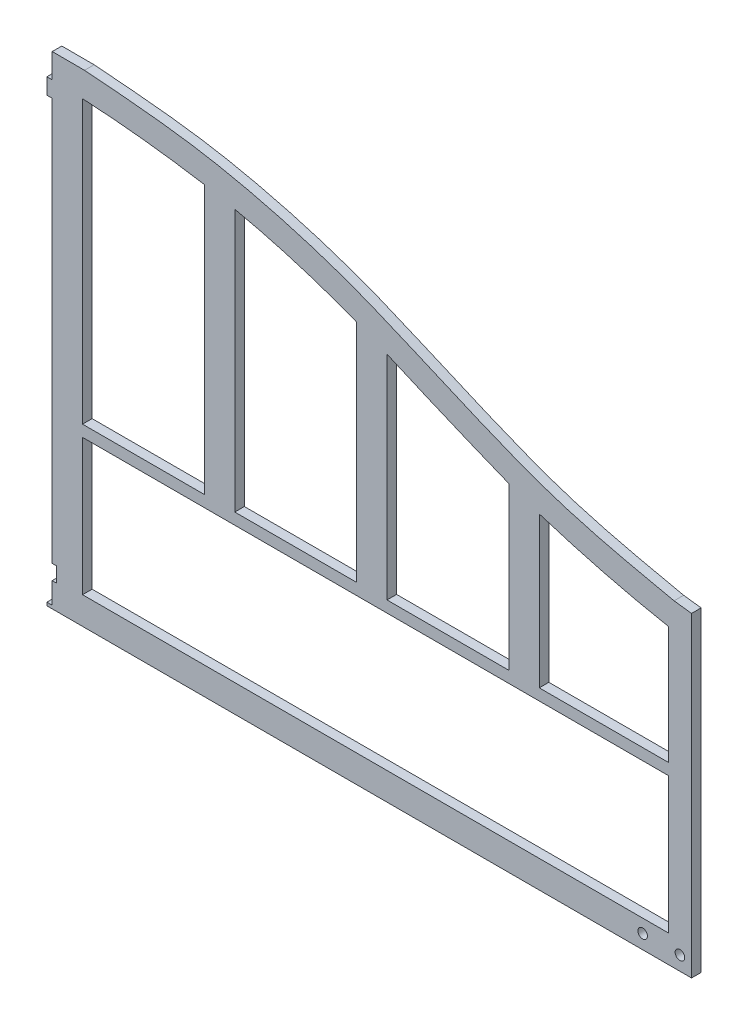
ISO-10303-21;
HEADER;
FILE_DESCRIPTION(('STEP AP214'),'2;1');
FILE_NAME('part.step','',(''),(''),'','','');
FILE_SCHEMA(('AUTOMOTIVE_DESIGN { 1 0 10303 214 1 1 1 1 }'));
ENDSEC;
DATA;
#1=APPLICATION_CONTEXT('core data for automotive mechanical design processes');
#2=APPLICATION_PROTOCOL_DEFINITION('international standard','automotive_design',2000,#1);
#3=PRODUCT_CONTEXT('',#1,'mechanical');
#4=PRODUCT('Part','Part','',(#3));
#5=PRODUCT_RELATED_PRODUCT_CATEGORY('part','',(#4));
#6=PRODUCT_DEFINITION_FORMATION('','',#4);
#7=PRODUCT_DEFINITION_CONTEXT('part definition',#1,'design');
#8=PRODUCT_DEFINITION('design','',#6,#7);
#9=PRODUCT_DEFINITION_SHAPE('','',#8);
#10=(LENGTH_UNIT() NAMED_UNIT(*) SI_UNIT(.MILLI.,.METRE.));
#11=(NAMED_UNIT(*) PLANE_ANGLE_UNIT() SI_UNIT($,.RADIAN.));
#12=(NAMED_UNIT(*) SI_UNIT($,.STERADIAN.) SOLID_ANGLE_UNIT());
#13=UNCERTAINTY_MEASURE_WITH_UNIT(LENGTH_MEASURE(1.E-05),#10,'distance_accuracy_value','');
#14=(GEOMETRIC_REPRESENTATION_CONTEXT(3) GLOBAL_UNCERTAINTY_ASSIGNED_CONTEXT((#13)) GLOBAL_UNIT_ASSIGNED_CONTEXT((#10,
#11,#12)) REPRESENTATION_CONTEXT('',''));
#15=CARTESIAN_POINT('',(0.,0.,0.));
#16=DIRECTION('',(0.,0.,1.));
#17=DIRECTION('',(1.,0.,0.));
#18=AXIS2_PLACEMENT_3D('',#15,#16,#17);
#19=CARTESIAN_POINT('',(321.765130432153,389.200273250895,9.));
#20=DIRECTION('',(0.,0.,-1.));
#21=DIRECTION('',(-1.,0.,0.));
#22=AXIS2_PLACEMENT_3D('',#19,#20,#21);
#23=PLANE('',#22);
#24=CARTESIAN_POINT('',(594.14,13.26,9.));
#25=DIRECTION('',(0.,0.,1.));
#26=DIRECTION('',(1.,0.,0.));
#27=AXIS2_PLACEMENT_3D('',#24,#25,#26);
#28=CIRCLE('',#27,4.49999999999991);
#29=CARTESIAN_POINT('',(598.64,13.26,9.));
#30=VERTEX_POINT('',#29);
#31=EDGE_CURVE('E296',#30,#30,#28,.T.);
#32=ORIENTED_EDGE('',*,*,#31,.F.);
#33=EDGE_LOOP('',(#32));
#34=FACE_BOUND('',#33,.T.);
#35=DIRECTION('',(0.,-1.,0.));
#36=VECTOR('',#35,1.);
#37=CARTESIAN_POINT('',(319.22,164.37,9.));
#38=LINE('',#37,#36);
#39=CARTESIAN_POINT('',(319.219999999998,364.150000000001,9.));
#40=VERTEX_POINT('',#39);
#41=CARTESIAN_POINT('',(319.22,164.37,9.));
#42=VERTEX_POINT('',#41);
#43=EDGE_CURVE('E306',#40,#42,#38,.T.);
#44=ORIENTED_EDGE('',*,*,#43,.F.);
#45=CARTESIAN_POINT('',(1744.55075063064,3598.67238732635,9.));
#46=DIRECTION('',(0.,0.,-1.));
#47=DIRECTION('',(1.,0.,0.));
#48=AXIS2_PLACEMENT_3D('',#45,#46,#47);
#49=CIRCLE('',#48,3534.64323840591);
#50=CARTESIAN_POINT('',(433.64,316.11,9.));
#51=VERTEX_POINT('',#50);
#52=EDGE_CURVE('E314',#51,#40,#49,.T.);
#53=ORIENTED_EDGE('',*,*,#52,.F.);
#54=DIRECTION('',(0.,1.,0.));
#55=VECTOR('',#54,1.);
#56=CARTESIAN_POINT('',(433.64,164.37,9.));
#57=LINE('',#56,#55);
#58=CARTESIAN_POINT('',(433.64,164.37,9.));
#59=VERTEX_POINT('',#58);
#60=EDGE_CURVE('E311',#59,#51,#57,.T.);
#61=ORIENTED_EDGE('',*,*,#60,.F.);
#62=DIRECTION('',(1.,0.,0.));
#63=VECTOR('',#62,1.);
#64=CARTESIAN_POINT('',(319.22,164.37,9.));
#65=LINE('',#64,#63);
#66=EDGE_CURVE('E308',#42,#59,#65,.T.);
#67=ORIENTED_EDGE('',*,*,#66,.F.);
#68=EDGE_LOOP('',(#44,#53,#61,#67));
#69=FACE_BOUND('',#68,.T.);
#70=DIRECTION('',(0.,-1.,0.));
#71=VECTOR('',#70,1.);
#72=CARTESIAN_POINT('',(33.46,164.37,9.));
#73=LINE('',#72,#71);
#74=CARTESIAN_POINT('',(33.4600000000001,428.94,9.));
#75=VERTEX_POINT('',#74);
#76=CARTESIAN_POINT('',(33.46,164.37,9.));
#77=VERTEX_POINT('',#76);
#78=EDGE_CURVE('E368',#75,#77,#73,.T.);
#79=ORIENTED_EDGE('',*,*,#78,.F.);
#80=CARTESIAN_POINT('',(-23.1208114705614,-603.405366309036,9.));
#81=DIRECTION('',(0.,0.,1.));
#82=DIRECTION('',(-1.,0.,0.));
#83=AXIS2_PLACEMENT_3D('',#80,#81,#82);
#84=CIRCLE('',#83,1033.89474491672);
#85=CARTESIAN_POINT('',(147.88,416.25,9.));
#86=VERTEX_POINT('',#85);
#87=EDGE_CURVE('E376',#86,#75,#84,.T.);
#88=ORIENTED_EDGE('',*,*,#87,.F.);
#89=DIRECTION('',(0.,1.,0.));
#90=VECTOR('',#89,1.);
#91=CARTESIAN_POINT('',(147.88,164.37,9.));
#92=LINE('',#91,#90);
#93=CARTESIAN_POINT('',(147.88,164.37,9.));
#94=VERTEX_POINT('',#93);
#95=EDGE_CURVE('E373',#94,#86,#92,.T.);
#96=ORIENTED_EDGE('',*,*,#95,.F.);
#97=DIRECTION('',(1.,0.,0.));
#98=VECTOR('',#97,1.);
#99=CARTESIAN_POINT('',(33.46,164.37,9.));
#100=LINE('',#99,#98);
#101=EDGE_CURVE('E370',#77,#94,#100,.T.);
#102=ORIENTED_EDGE('',*,*,#101,.F.);
#103=EDGE_LOOP('',(#79,#88,#96,#102));
#104=FACE_BOUND('',#103,.T.);
#105=DIRECTION('',(0.,-1.,0.));
#106=VECTOR('',#105,1.);
#107=CARTESIAN_POINT('',(0.,0.,9.));
#108=LINE('',#107,#106);
#109=CARTESIAN_POINT('',(0.,3.,9.));
#110=VERTEX_POINT('',#109);
#111=CARTESIAN_POINT('',(0.,0.,9.));
#112=VERTEX_POINT('',#111);
#113=EDGE_CURVE('E430',#110,#112,#108,.T.);
#114=ORIENTED_EDGE('',*,*,#113,.T.);
#115=DIRECTION('',(1.,0.,0.));
#116=VECTOR('',#115,1.);
#117=CARTESIAN_POINT('',(0.,0.,9.));
#118=LINE('',#117,#116);
#119=CARTESIAN_POINT('',(605.,0.,9.));
#120=VERTEX_POINT('',#119);
#121=EDGE_CURVE('E433',#112,#120,#118,.T.);
#122=ORIENTED_EDGE('',*,*,#121,.T.);
#123=DIRECTION('',(0.,1.,0.));
#124=VECTOR('',#123,1.);
#125=CARTESIAN_POINT('',(605.,0.,9.));
#126=LINE('',#125,#124);
#127=CARTESIAN_POINT('',(605.,296.33,9.));
#128=VERTEX_POINT('',#127);
#129=EDGE_CURVE('E436',#120,#128,#126,.T.);
#130=ORIENTED_EDGE('',*,*,#129,.T.);
#131=DIRECTION('',(-0.992286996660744,0.123961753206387,0.));
#132=VECTOR('',#131,1.);
#133=CARTESIAN_POINT('',(588.619123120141,298.37638599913,9.));
#134=LINE('',#133,#132);
#135=CARTESIAN_POINT('',(588.619123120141,298.37638599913,9.));
#136=VERTEX_POINT('',#135);
#137=EDGE_CURVE('E438',#128,#136,#134,.T.);
#138=ORIENTED_EDGE('',*,*,#137,.T.);
#139=CARTESIAN_POINT('',(588.619123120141,298.37638599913,9.));
#140=CARTESIAN_POINT('',(582.77467448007,299.628210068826,9.));
#141=CARTESIAN_POINT('',(571.057947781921,302.137859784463,9.));
#142=CARTESIAN_POINT('',(547.870565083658,307.218352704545,9.));
#143=CARTESIAN_POINT('',(519.267646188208,313.909682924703,9.));
#144=CARTESIAN_POINT('',(491.33497959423,321.566975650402,9.));
#145=CARTESIAN_POINT('',(469.547899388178,328.540459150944,9.));
#146=CARTESIAN_POINT('',(453.312778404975,334.331172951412,9.));
#147=CARTESIAN_POINT('',(436.917223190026,340.597353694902,9.));
#148=CARTESIAN_POINT('',(415.100784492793,349.304912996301,9.));
#149=CARTESIAN_POINT('',(387.848792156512,360.754876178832,9.));
#150=CARTESIAN_POINT('',(360.488388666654,372.606028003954,9.));
#151=CARTESIAN_POINT('',(338.433024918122,382.117843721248,9.));
#152=CARTESIAN_POINT('',(321.820581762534,389.209175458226,9.));
#153=CARTESIAN_POINT('',(304.875430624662,396.247093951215,9.));
#154=CARTESIAN_POINT('',(287.528836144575,402.977542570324,9.));
#155=CARTESIAN_POINT('',(270.069351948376,409.235694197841,9.));
#156=CARTESIAN_POINT('',(246.589569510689,417.010976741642,9.));
#157=CARTESIAN_POINT('',(222.870324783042,423.931585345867,9.));
#158=CARTESIAN_POINT('',(198.959310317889,430.038741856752,9.));
#159=CARTESIAN_POINT('',(180.969171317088,434.214658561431,9.));
#160=CARTESIAN_POINT('',(162.845786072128,438.018110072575,9.));
#161=CARTESIAN_POINT('',(144.450561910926,441.341870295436,9.));
#162=CARTESIAN_POINT('',(126.097309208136,444.099034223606,9.));
#163=CARTESIAN_POINT('',(107.789338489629,446.408441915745,9.));
#164=CARTESIAN_POINT('',(89.5429851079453,448.355525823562,9.));
#165=CARTESIAN_POINT('',(71.375474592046,450.032262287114,9.));
#166=CARTESIAN_POINT('',(53.2823740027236,451.528423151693,9.));
#167=CARTESIAN_POINT('',(41.322386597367,452.460296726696,9.));
#168=CARTESIAN_POINT('',(35.3290739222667,452.927291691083,9.));
#169=B_SPLINE_CURVE_WITH_KNOTS('',3,(#139,#140,#141,#142,#143,#144,#145,#146,#147,#148,#149,
#150,#151,#152,#153,#154,#155,#156,#157,#158,#159,#160,#161,#162,#163,#164,#165,#166,#167,#168),
.UNSPECIFIED.,.F.,.F.,(4,1,1,1,1,1,1,1,1,1,1,1,1,1,1,1,1,1,1,1,1,1,1,1,1,1,1,4),(0.,0.03125,
0.0625,0.125,0.1875,0.21875,0.25,0.28125,0.3125,0.375,0.4375,0.46875,0.5,0.53125,0.5625,0.59375,
0.625,0.6875,0.71875,0.75,0.78125,0.8125,0.84375,0.875,0.90625,0.9375,0.96875,1.),.UNSPECIFIED.);
#170=CARTESIAN_POINT('',(35.3290739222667,452.927291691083,9.));
#171=VERTEX_POINT('',#170);
#172=EDGE_CURVE('E440',#136,#171,#169,.T.);
#173=ORIENTED_EDGE('',*,*,#172,.T.);
#174=DIRECTION('',(-0.999997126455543,0.00239730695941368,0.));
#175=VECTOR('',#174,1.);
#176=CARTESIAN_POINT('',(35.3290739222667,452.927291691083,9.));
#177=LINE('',#176,#175);
#178=CARTESIAN_POINT('',(5.,453.,9.));
#179=VERTEX_POINT('',#178);
#180=EDGE_CURVE('E445',#171,#179,#177,.T.);
#181=ORIENTED_EDGE('',*,*,#180,.T.);
#182=DIRECTION('',(0.,-1.,0.));
#183=VECTOR('',#182,1.);
#184=CARTESIAN_POINT('',(5.,430.,9.));
#185=LINE('',#184,#183);
#186=CARTESIAN_POINT('',(5.,430.,9.));
#187=VERTEX_POINT('',#186);
#188=EDGE_CURVE('E656',#179,#187,#185,.T.);
#189=ORIENTED_EDGE('',*,*,#188,.T.);
#190=DIRECTION('',(-1.,0.,0.));
#191=VECTOR('',#190,1.);
#192=CARTESIAN_POINT('',(0.,430.,9.));
#193=LINE('',#192,#191);
#194=CARTESIAN_POINT('',(0.,430.,9.));
#195=VERTEX_POINT('',#194);
#196=EDGE_CURVE('E547',#187,#195,#193,.T.);
#197=ORIENTED_EDGE('',*,*,#196,.T.);
#198=DIRECTION('',(0.,-1.,0.));
#199=VECTOR('',#198,1.);
#200=CARTESIAN_POINT('',(0.,415.,9.));
#201=LINE('',#200,#199);
#202=CARTESIAN_POINT('',(0.,415.,9.));
#203=VERTEX_POINT('',#202);
#204=EDGE_CURVE('E654',#195,#203,#201,.T.);
#205=ORIENTED_EDGE('',*,*,#204,.T.);
#206=DIRECTION('',(1.,0.,0.));
#207=VECTOR('',#206,1.);
#208=CARTESIAN_POINT('',(5.,415.,9.));
#209=LINE('',#208,#207);
#210=CARTESIAN_POINT('',(5.,415.,9.));
#211=VERTEX_POINT('',#210);
#212=EDGE_CURVE('E652',#203,#211,#209,.T.);
#213=ORIENTED_EDGE('',*,*,#212,.T.);
#214=DIRECTION('',(0.,-1.,0.));
#215=VECTOR('',#214,1.);
#216=CARTESIAN_POINT('',(5.,37.,9.));
#217=LINE('',#216,#215);
#218=CARTESIAN_POINT('',(5.,37.,9.));
#219=VERTEX_POINT('',#218);
#220=EDGE_CURVE('E650',#211,#219,#217,.T.);
#221=ORIENTED_EDGE('',*,*,#220,.T.);
#222=DIRECTION('',(1.,0.,0.));
#223=VECTOR('',#222,1.);
#224=CARTESIAN_POINT('',(9.,37.,9.));
#225=LINE('',#224,#223);
#226=CARTESIAN_POINT('',(9.,37.,9.));
#227=VERTEX_POINT('',#226);
#228=EDGE_CURVE('E648',#219,#227,#225,.T.);
#229=ORIENTED_EDGE('',*,*,#228,.T.);
#230=DIRECTION('',(0.,-1.,0.));
#231=VECTOR('',#230,1.);
#232=CARTESIAN_POINT('',(9.,23.,9.));
#233=LINE('',#232,#231);
#234=CARTESIAN_POINT('',(9.,23.,9.));
#235=VERTEX_POINT('',#234);
#236=EDGE_CURVE('E646',#227,#235,#233,.T.);
#237=ORIENTED_EDGE('',*,*,#236,.T.);
#238=DIRECTION('',(-1.,0.,0.));
#239=VECTOR('',#238,1.);
#240=CARTESIAN_POINT('',(5.,23.,9.));
#241=LINE('',#240,#239);
#242=CARTESIAN_POINT('',(5.,23.,9.));
#243=VERTEX_POINT('',#242);
#244=EDGE_CURVE('E644',#235,#243,#241,.T.);
#245=ORIENTED_EDGE('',*,*,#244,.T.);
#246=DIRECTION('',(0.,-1.,0.));
#247=VECTOR('',#246,1.);
#248=CARTESIAN_POINT('',(5.,3.,9.));
#249=LINE('',#248,#247);
#250=CARTESIAN_POINT('',(5.,3.,9.));
#251=VERTEX_POINT('',#250);
#252=EDGE_CURVE('E642',#243,#251,#249,.T.);
#253=ORIENTED_EDGE('',*,*,#252,.T.);
#254=DIRECTION('',(-1.,0.,0.));
#255=VECTOR('',#254,1.);
#256=CARTESIAN_POINT('',(0.,3.,9.));
#257=LINE('',#256,#255);
#258=EDGE_CURVE('E576',#251,#110,#257,.T.);
#259=ORIENTED_EDGE('',*,*,#258,.T.);
#260=EDGE_LOOP('',(#114,#122,#130,#138,#173,#181,#189,#197,#205,#213,#221,#229,#237,#245,#253,#259));
#261=FACE_BOUND('',#260,.T.);
#262=DIRECTION('',(0.,-1.,0.));
#263=VECTOR('',#262,1.);
#264=CARTESIAN_POINT('',(33.46,25.76,9.));
#265=LINE('',#264,#263);
#266=CARTESIAN_POINT('',(33.46,153.66,9.));
#267=VERTEX_POINT('',#266);
#268=CARTESIAN_POINT('',(33.46,25.76,9.));
#269=VERTEX_POINT('',#268);
#270=EDGE_CURVE('E399',#267,#269,#265,.T.);
#271=ORIENTED_EDGE('',*,*,#270,.F.);
#272=DIRECTION('',(-1.,0.,0.));
#273=VECTOR('',#272,1.);
#274=CARTESIAN_POINT('',(33.46,153.66,9.));
#275=LINE('',#274,#273);
#276=CARTESIAN_POINT('',(583.6,153.66,9.));
#277=VERTEX_POINT('',#276);
#278=EDGE_CURVE('E407',#277,#267,#275,.T.);
#279=ORIENTED_EDGE('',*,*,#278,.F.);
#280=DIRECTION('',(0.,1.,0.));
#281=VECTOR('',#280,1.);
#282=CARTESIAN_POINT('',(583.6,25.76,9.));
#283=LINE('',#282,#281);
#284=CARTESIAN_POINT('',(583.6,25.76,9.));
#285=VERTEX_POINT('',#284);
#286=EDGE_CURVE('E404',#285,#277,#283,.T.);
#287=ORIENTED_EDGE('',*,*,#286,.F.);
#288=DIRECTION('',(1.,0.,0.));
#289=VECTOR('',#288,1.);
#290=CARTESIAN_POINT('',(33.46,25.76,9.));
#291=LINE('',#290,#289);
#292=EDGE_CURVE('E401',#269,#285,#291,.T.);
#293=ORIENTED_EDGE('',*,*,#292,.F.);
#294=EDGE_LOOP('',(#271,#279,#287,#293));
#295=FACE_BOUND('',#294,.T.);
#296=DIRECTION('',(0.,-1.,0.));
#297=VECTOR('',#296,1.);
#298=CARTESIAN_POINT('',(176.34,164.37,9.));
#299=LINE('',#298,#297);
#300=CARTESIAN_POINT('',(176.34,410.53,9.));
#301=VERTEX_POINT('',#300);
#302=CARTESIAN_POINT('',(176.34,164.37,9.));
#303=VERTEX_POINT('',#302);
#304=EDGE_CURVE('E337',#301,#303,#299,.T.);
#305=ORIENTED_EDGE('',*,*,#304,.F.);
#306=CARTESIAN_POINT('',(20.3928232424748,-310.873261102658,9.));
#307=DIRECTION('',(0.,0.,1.));
#308=DIRECTION('',(-1.,0.,0.));
#309=AXIS2_PLACEMENT_3D('',#306,#307,#308);
#310=CIRCLE('',#309,738.066519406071);
#311=CARTESIAN_POINT('',(290.76,375.89,9.));
#312=VERTEX_POINT('',#311);
#313=EDGE_CURVE('E345',#312,#301,#310,.T.);
#314=ORIENTED_EDGE('',*,*,#313,.F.);
#315=DIRECTION('',(0.,1.,0.));
#316=VECTOR('',#315,1.);
#317=CARTESIAN_POINT('',(290.76,164.37,9.));
#318=LINE('',#317,#316);
#319=CARTESIAN_POINT('',(290.76,164.37,9.));
#320=VERTEX_POINT('',#319);
#321=EDGE_CURVE('E342',#320,#312,#318,.T.);
#322=ORIENTED_EDGE('',*,*,#321,.F.);
#323=DIRECTION('',(1.,0.,0.));
#324=VECTOR('',#323,1.);
#325=CARTESIAN_POINT('',(176.34,164.37,9.));
#326=LINE('',#325,#324);
#327=EDGE_CURVE('E339',#303,#320,#326,.T.);
#328=ORIENTED_EDGE('',*,*,#327,.F.);
#329=EDGE_LOOP('',(#305,#314,#322,#328));
#330=FACE_BOUND('',#329,.T.);
#331=DIRECTION('',(0.,-1.,0.));
#332=VECTOR('',#331,1.);
#333=CARTESIAN_POINT('',(462.1,164.37,9.));
#334=LINE('',#333,#332);
#335=CARTESIAN_POINT('',(462.1,305.76,9.));
#336=VERTEX_POINT('',#335);
#337=CARTESIAN_POINT('',(462.1,164.37,9.));
#338=VERTEX_POINT('',#337);
#339=EDGE_CURVE('E267',#336,#338,#334,.T.);
#340=ORIENTED_EDGE('',*,*,#339,.F.);
#341=CARTESIAN_POINT('',(775.41969725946,1282.97344461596,9.));
#342=DIRECTION('',(0.,0.,-1.));
#343=DIRECTION('',(1.,0.,0.));
#344=AXIS2_PLACEMENT_3D('',#341,#342,#343);
#345=CIRCLE('',#344,1026.21408537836);
#346=CARTESIAN_POINT('',(583.58,274.85,9.));
#347=VERTEX_POINT('',#346);
#348=EDGE_CURVE('E290',#347,#336,#345,.T.);
#349=ORIENTED_EDGE('',*,*,#348,.F.);
#350=DIRECTION('',(0.,1.,0.));
#351=VECTOR('',#350,1.);
#352=CARTESIAN_POINT('',(583.58,164.37,9.));
#353=LINE('',#352,#351);
#354=CARTESIAN_POINT('',(583.58,164.37,9.));
#355=VERTEX_POINT('',#354);
#356=EDGE_CURVE('E288',#355,#347,#353,.T.);
#357=ORIENTED_EDGE('',*,*,#356,.F.);
#358=DIRECTION('',(1.,0.,0.));
#359=VECTOR('',#358,1.);
#360=CARTESIAN_POINT('',(462.1,164.37,9.));
#361=LINE('',#360,#359);
#362=EDGE_CURVE('E275',#338,#355,#361,.T.);
#363=ORIENTED_EDGE('',*,*,#362,.F.);
#364=EDGE_LOOP('',(#340,#349,#357,#363));
#365=FACE_BOUND('',#364,.T.);
#366=CARTESIAN_POINT('',(559.14,13.26,9.));
#367=DIRECTION('',(0.,0.,1.));
#368=DIRECTION('',(1.,0.,0.));
#369=AXIS2_PLACEMENT_3D('',#366,#367,#368);
#370=CIRCLE('',#369,4.49999999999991);
#371=CARTESIAN_POINT('',(563.64,13.26,9.));
#372=VERTEX_POINT('',#371);
#373=EDGE_CURVE('E1007',#372,#372,#370,.T.);
#374=ORIENTED_EDGE('',*,*,#373,.F.);
#375=EDGE_LOOP('',(#374));
#376=FACE_BOUND('',#375,.T.);
#377=ADVANCED_FACE('F34',(#34,#69,#104,#261,#295,#330,#365,#376),#23,.F.);
#378=CARTESIAN_POINT('',(321.765130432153,389.200273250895,0.));
#379=DIRECTION('',(0.,0.,-1.));
#380=DIRECTION('',(-1.,0.,0.));
#381=AXIS2_PLACEMENT_3D('',#378,#379,#380);
#382=PLANE('',#381);
#383=CARTESIAN_POINT('',(594.14,13.26,0.));
#384=DIRECTION('',(0.,0.,1.));
#385=DIRECTION('',(1.,0.,0.));
#386=AXIS2_PLACEMENT_3D('',#383,#384,#385);
#387=CIRCLE('',#386,4.49999999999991);
#388=CARTESIAN_POINT('',(598.64,13.26,0.));
#389=VERTEX_POINT('',#388);
#390=EDGE_CURVE('E1013',#389,#389,#387,.T.);
#391=ORIENTED_EDGE('',*,*,#390,.T.);
#392=EDGE_LOOP('',(#391));
#393=FACE_BOUND('',#392,.T.);
#394=CARTESIAN_POINT('',(1744.55075063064,3598.67238732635,0.));
#395=DIRECTION('',(0.,0.,-1.));
#396=DIRECTION('',(1.,0.,0.));
#397=AXIS2_PLACEMENT_3D('',#394,#395,#396);
#398=CIRCLE('',#397,3534.64323840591);
#399=CARTESIAN_POINT('',(433.64,316.11,0.));
#400=VERTEX_POINT('',#399);
#401=CARTESIAN_POINT('',(319.219999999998,364.150000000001,0.));
#402=VERTEX_POINT('',#401);
#403=EDGE_CURVE('E309',#400,#402,#398,.T.);
#404=ORIENTED_EDGE('',*,*,#403,.T.);
#405=DIRECTION('',(0.,-1.,0.));
#406=VECTOR('',#405,1.);
#407=CARTESIAN_POINT('',(319.22,164.37,0.));
#408=LINE('',#407,#406);
#409=CARTESIAN_POINT('',(319.22,164.37,0.));
#410=VERTEX_POINT('',#409);
#411=EDGE_CURVE('E283',#402,#410,#408,.T.);
#412=ORIENTED_EDGE('',*,*,#411,.T.);
#413=DIRECTION('',(1.,0.,0.));
#414=VECTOR('',#413,1.);
#415=CARTESIAN_POINT('',(319.22,164.37,0.));
#416=LINE('',#415,#414);
#417=CARTESIAN_POINT('',(433.64,164.37,0.));
#418=VERTEX_POINT('',#417);
#419=EDGE_CURVE('E319',#410,#418,#416,.T.);
#420=ORIENTED_EDGE('',*,*,#419,.T.);
#421=DIRECTION('',(0.,1.,0.));
#422=VECTOR('',#421,1.);
#423=CARTESIAN_POINT('',(433.64,164.37,0.));
#424=LINE('',#423,#422);
#425=EDGE_CURVE('E322',#418,#400,#424,.T.);
#426=ORIENTED_EDGE('',*,*,#425,.T.);
#427=EDGE_LOOP('',(#404,#412,#420,#426));
#428=FACE_BOUND('',#427,.T.);
#429=CARTESIAN_POINT('',(-23.1208114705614,-603.405366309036,0.));
#430=DIRECTION('',(0.,0.,1.));
#431=DIRECTION('',(-1.,0.,0.));
#432=AXIS2_PLACEMENT_3D('',#429,#430,#431);
#433=CIRCLE('',#432,1033.89474491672);
#434=CARTESIAN_POINT('',(147.88,416.25,0.));
#435=VERTEX_POINT('',#434);
#436=CARTESIAN_POINT('',(33.4600000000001,428.94,0.));
#437=VERTEX_POINT('',#436);
#438=EDGE_CURVE('E371',#435,#437,#433,.T.);
#439=ORIENTED_EDGE('',*,*,#438,.T.);
#440=DIRECTION('',(0.,-1.,0.));
#441=VECTOR('',#440,1.);
#442=CARTESIAN_POINT('',(33.46,164.37,0.));
#443=LINE('',#442,#441);
#444=CARTESIAN_POINT('',(33.46,164.37,0.));
#445=VERTEX_POINT('',#444);
#446=EDGE_CURVE('E367',#437,#445,#443,.T.);
#447=ORIENTED_EDGE('',*,*,#446,.T.);
#448=DIRECTION('',(1.,0.,0.));
#449=VECTOR('',#448,1.);
#450=CARTESIAN_POINT('',(33.46,164.37,0.));
#451=LINE('',#450,#449);
#452=CARTESIAN_POINT('',(147.88,164.37,0.));
#453=VERTEX_POINT('',#452);
#454=EDGE_CURVE('E381',#445,#453,#451,.T.);
#455=ORIENTED_EDGE('',*,*,#454,.T.);
#456=DIRECTION('',(0.,1.,0.));
#457=VECTOR('',#456,1.);
#458=CARTESIAN_POINT('',(147.88,164.37,0.));
#459=LINE('',#458,#457);
#460=EDGE_CURVE('E384',#453,#435,#459,.T.);
#461=ORIENTED_EDGE('',*,*,#460,.T.);
#462=EDGE_LOOP('',(#439,#447,#455,#461));
#463=FACE_BOUND('',#462,.T.);
#464=DIRECTION('',(0.,-1.,0.));
#465=VECTOR('',#464,1.);
#466=CARTESIAN_POINT('',(0.,0.,0.));
#467=LINE('',#466,#465);
#468=CARTESIAN_POINT('',(0.,3.,0.));
#469=VERTEX_POINT('',#468);
#470=CARTESIAN_POINT('',(0.,0.,0.));
#471=VERTEX_POINT('',#470);
#472=EDGE_CURVE('E429',#469,#471,#467,.T.);
#473=ORIENTED_EDGE('',*,*,#472,.F.);
#474=DIRECTION('',(-1.,0.,0.));
#475=VECTOR('',#474,1.);
#476=CARTESIAN_POINT('',(0.,3.,0.));
#477=LINE('',#476,#475);
#478=CARTESIAN_POINT('',(5.,3.,0.));
#479=VERTEX_POINT('',#478);
#480=EDGE_CURVE('E434',#479,#469,#477,.T.);
#481=ORIENTED_EDGE('',*,*,#480,.F.);
#482=DIRECTION('',(0.,-1.,0.));
#483=VECTOR('',#482,1.);
#484=CARTESIAN_POINT('',(5.,3.,0.));
#485=LINE('',#484,#483);
#486=CARTESIAN_POINT('',(5.,23.,0.));
#487=VERTEX_POINT('',#486);
#488=EDGE_CURVE('E569',#487,#479,#485,.T.);
#489=ORIENTED_EDGE('',*,*,#488,.F.);
#490=DIRECTION('',(-1.,0.,0.));
#491=VECTOR('',#490,1.);
#492=CARTESIAN_POINT('',(5.,23.,0.));
#493=LINE('',#492,#491);
#494=CARTESIAN_POINT('',(9.,23.,0.));
#495=VERTEX_POINT('',#494);
#496=EDGE_CURVE('E567',#495,#487,#493,.T.);
#497=ORIENTED_EDGE('',*,*,#496,.F.);
#498=DIRECTION('',(0.,-1.,0.));
#499=VECTOR('',#498,1.);
#500=CARTESIAN_POINT('',(9.,23.,0.));
#501=LINE('',#500,#499);
#502=CARTESIAN_POINT('',(9.,37.,0.));
#503=VERTEX_POINT('',#502);
#504=EDGE_CURVE('E565',#503,#495,#501,.T.);
#505=ORIENTED_EDGE('',*,*,#504,.F.);
#506=DIRECTION('',(1.,0.,0.));
#507=VECTOR('',#506,1.);
#508=CARTESIAN_POINT('',(9.,37.,0.));
#509=LINE('',#508,#507);
#510=CARTESIAN_POINT('',(5.,37.,0.));
#511=VERTEX_POINT('',#510);
#512=EDGE_CURVE('E563',#511,#503,#509,.T.);
#513=ORIENTED_EDGE('',*,*,#512,.F.);
#514=DIRECTION('',(0.,-1.,0.));
#515=VECTOR('',#514,1.);
#516=CARTESIAN_POINT('',(5.,37.,0.));
#517=LINE('',#516,#515);
#518=CARTESIAN_POINT('',(5.,415.,0.));
#519=VERTEX_POINT('',#518);
#520=EDGE_CURVE('E561',#519,#511,#517,.T.);
#521=ORIENTED_EDGE('',*,*,#520,.F.);
#522=DIRECTION('',(1.,0.,0.));
#523=VECTOR('',#522,1.);
#524=CARTESIAN_POINT('',(5.,415.,0.));
#525=LINE('',#524,#523);
#526=CARTESIAN_POINT('',(0.,415.,0.));
#527=VERTEX_POINT('',#526);
#528=EDGE_CURVE('E556',#527,#519,#525,.T.);
#529=ORIENTED_EDGE('',*,*,#528,.F.);
#530=DIRECTION('',(0.,-1.,0.));
#531=VECTOR('',#530,1.);
#532=CARTESIAN_POINT('',(0.,415.,0.));
#533=LINE('',#532,#531);
#534=CARTESIAN_POINT('',(0.,430.,0.));
#535=VERTEX_POINT('',#534);
#536=EDGE_CURVE('E554',#535,#527,#533,.T.);
#537=ORIENTED_EDGE('',*,*,#536,.F.);
#538=DIRECTION('',(-1.,0.,0.));
#539=VECTOR('',#538,1.);
#540=CARTESIAN_POINT('',(0.,430.,0.));
#541=LINE('',#540,#539);
#542=CARTESIAN_POINT('',(5.,430.,0.));
#543=VERTEX_POINT('',#542);
#544=EDGE_CURVE('E542',#543,#535,#541,.T.);
#545=ORIENTED_EDGE('',*,*,#544,.F.);
#546=DIRECTION('',(0.,-1.,0.));
#547=VECTOR('',#546,1.);
#548=CARTESIAN_POINT('',(5.,430.,0.));
#549=LINE('',#548,#547);
#550=CARTESIAN_POINT('',(5.,453.,0.));
#551=VERTEX_POINT('',#550);
#552=EDGE_CURVE('E532',#551,#543,#549,.T.);
#553=ORIENTED_EDGE('',*,*,#552,.F.);
#554=DIRECTION('',(-0.999997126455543,0.00239730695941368,0.));
#555=VECTOR('',#554,1.);
#556=CARTESIAN_POINT('',(35.3290739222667,452.927291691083,0.));
#557=LINE('',#556,#555);
#558=CARTESIAN_POINT('',(35.3290739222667,452.927291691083,0.));
#559=VERTEX_POINT('',#558);
#560=EDGE_CURVE('E543',#559,#551,#557,.T.);
#561=ORIENTED_EDGE('',*,*,#560,.F.);
#562=CARTESIAN_POINT('',(588.619123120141,298.37638599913,0.));
#563=CARTESIAN_POINT('',(582.77467448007,299.628210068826,0.));
#564=CARTESIAN_POINT('',(571.057947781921,302.137859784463,0.));
#565=CARTESIAN_POINT('',(547.870565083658,307.218352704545,0.));
#566=CARTESIAN_POINT('',(519.267646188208,313.909682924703,0.));
#567=CARTESIAN_POINT('',(491.33497959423,321.566975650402,0.));
#568=CARTESIAN_POINT('',(469.547899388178,328.540459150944,0.));
#569=CARTESIAN_POINT('',(453.312778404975,334.331172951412,0.));
#570=CARTESIAN_POINT('',(436.917223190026,340.597353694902,0.));
#571=CARTESIAN_POINT('',(415.100784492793,349.304912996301,0.));
#572=CARTESIAN_POINT('',(387.848792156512,360.754876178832,0.));
#573=CARTESIAN_POINT('',(360.488388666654,372.606028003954,0.));
#574=CARTESIAN_POINT('',(338.433024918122,382.117843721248,0.));
#575=CARTESIAN_POINT('',(321.820581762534,389.209175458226,0.));
#576=CARTESIAN_POINT('',(304.875430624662,396.247093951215,0.));
#577=CARTESIAN_POINT('',(287.528836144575,402.977542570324,0.));
#578=CARTESIAN_POINT('',(270.069351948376,409.235694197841,0.));
#579=CARTESIAN_POINT('',(246.589569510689,417.010976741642,0.));
#580=CARTESIAN_POINT('',(222.870324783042,423.931585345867,0.));
#581=CARTESIAN_POINT('',(198.959310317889,430.038741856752,0.));
#582=CARTESIAN_POINT('',(180.969171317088,434.214658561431,0.));
#583=CARTESIAN_POINT('',(162.845786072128,438.018110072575,0.));
#584=CARTESIAN_POINT('',(144.450561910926,441.341870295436,0.));
#585=CARTESIAN_POINT('',(126.097309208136,444.099034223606,0.));
#586=CARTESIAN_POINT('',(107.789338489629,446.408441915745,0.));
#587=CARTESIAN_POINT('',(89.5429851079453,448.355525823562,0.));
#588=CARTESIAN_POINT('',(71.375474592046,450.032262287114,0.));
#589=CARTESIAN_POINT('',(53.2823740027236,451.528423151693,0.));
#590=CARTESIAN_POINT('',(41.322386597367,452.460296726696,0.));
#591=CARTESIAN_POINT('',(35.3290739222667,452.927291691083,0.));
#592=B_SPLINE_CURVE_WITH_KNOTS('',3,(#562,#563,#564,#565,#566,#567,#568,#569,#570,#571,#572,
#573,#574,#575,#576,#577,#578,#579,#580,#581,#582,#583,#584,#585,#586,#587,#588,#589,#590,#591),
.UNSPECIFIED.,.F.,.F.,(4,1,1,1,1,1,1,1,1,1,1,1,1,1,1,1,1,1,1,1,1,1,1,1,1,1,1,4),(0.,0.03125,
0.0625,0.125,0.1875,0.21875,0.25,0.28125,0.3125,0.375,0.4375,0.46875,0.5,0.53125,0.5625,0.59375,
0.625,0.6875,0.71875,0.75,0.78125,0.8125,0.84375,0.875,0.90625,0.9375,0.96875,1.),.UNSPECIFIED.);
#593=CARTESIAN_POINT('',(588.619123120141,298.37638599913,0.));
#594=VERTEX_POINT('',#593);
#595=EDGE_CURVE('E618',#594,#559,#592,.T.);
#596=ORIENTED_EDGE('',*,*,#595,.F.);
#597=DIRECTION('',(-0.992286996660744,0.123961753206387,0.));
#598=VECTOR('',#597,1.);
#599=CARTESIAN_POINT('',(588.619123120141,298.37638599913,0.));
#600=LINE('',#599,#598);
#601=CARTESIAN_POINT('',(605.,296.33,0.));
#602=VERTEX_POINT('',#601);
#603=EDGE_CURVE('E616',#602,#594,#600,.T.);
#604=ORIENTED_EDGE('',*,*,#603,.F.);
#605=DIRECTION('',(0.,1.,0.));
#606=VECTOR('',#605,1.);
#607=CARTESIAN_POINT('',(605.,0.,0.));
#608=LINE('',#607,#606);
#609=CARTESIAN_POINT('',(605.,0.,0.));
#610=VERTEX_POINT('',#609);
#611=EDGE_CURVE('E612',#610,#602,#608,.T.);
#612=ORIENTED_EDGE('',*,*,#611,.F.);
#613=DIRECTION('',(1.,0.,0.));
#614=VECTOR('',#613,1.);
#615=CARTESIAN_POINT('',(0.,0.,0.));
#616=LINE('',#615,#614);
#617=EDGE_CURVE('E614',#471,#610,#616,.T.);
#618=ORIENTED_EDGE('',*,*,#617,.F.);
#619=EDGE_LOOP('',(#473,#481,#489,#497,#505,#513,#521,#529,#537,#545,#553,#561,#596,#604,#612,#618));
#620=FACE_BOUND('',#619,.T.);
#621=DIRECTION('',(-1.,0.,0.));
#622=VECTOR('',#621,1.);
#623=CARTESIAN_POINT('',(33.46,153.66,0.));
#624=LINE('',#623,#622);
#625=CARTESIAN_POINT('',(583.6,153.66,0.));
#626=VERTEX_POINT('',#625);
#627=CARTESIAN_POINT('',(33.46,153.66,0.));
#628=VERTEX_POINT('',#627);
#629=EDGE_CURVE('E402',#626,#628,#624,.T.);
#630=ORIENTED_EDGE('',*,*,#629,.T.);
#631=DIRECTION('',(0.,-1.,0.));
#632=VECTOR('',#631,1.);
#633=CARTESIAN_POINT('',(33.46,25.76,0.));
#634=LINE('',#633,#632);
#635=CARTESIAN_POINT('',(33.46,25.76,0.));
#636=VERTEX_POINT('',#635);
#637=EDGE_CURVE('E398',#628,#636,#634,.T.);
#638=ORIENTED_EDGE('',*,*,#637,.T.);
#639=DIRECTION('',(1.,0.,0.));
#640=VECTOR('',#639,1.);
#641=CARTESIAN_POINT('',(33.46,25.76,0.));
#642=LINE('',#641,#640);
#643=CARTESIAN_POINT('',(583.6,25.76,0.));
#644=VERTEX_POINT('',#643);
#645=EDGE_CURVE('E412',#636,#644,#642,.T.);
#646=ORIENTED_EDGE('',*,*,#645,.T.);
#647=DIRECTION('',(0.,1.,0.));
#648=VECTOR('',#647,1.);
#649=CARTESIAN_POINT('',(583.6,25.76,0.));
#650=LINE('',#649,#648);
#651=EDGE_CURVE('E415',#644,#626,#650,.T.);
#652=ORIENTED_EDGE('',*,*,#651,.T.);
#653=EDGE_LOOP('',(#630,#638,#646,#652));
#654=FACE_BOUND('',#653,.T.);
#655=CARTESIAN_POINT('',(20.3928232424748,-310.873261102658,0.));
#656=DIRECTION('',(0.,0.,1.));
#657=DIRECTION('',(-1.,0.,0.));
#658=AXIS2_PLACEMENT_3D('',#655,#656,#657);
#659=CIRCLE('',#658,738.066519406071);
#660=CARTESIAN_POINT('',(290.76,375.89,0.));
#661=VERTEX_POINT('',#660);
#662=CARTESIAN_POINT('',(176.34,410.53,0.));
#663=VERTEX_POINT('',#662);
#664=EDGE_CURVE('E340',#661,#663,#659,.T.);
#665=ORIENTED_EDGE('',*,*,#664,.T.);
#666=DIRECTION('',(0.,-1.,0.));
#667=VECTOR('',#666,1.);
#668=CARTESIAN_POINT('',(176.34,164.37,0.));
#669=LINE('',#668,#667);
#670=CARTESIAN_POINT('',(176.34,164.37,0.));
#671=VERTEX_POINT('',#670);
#672=EDGE_CURVE('E336',#663,#671,#669,.T.);
#673=ORIENTED_EDGE('',*,*,#672,.T.);
#674=DIRECTION('',(1.,0.,0.));
#675=VECTOR('',#674,1.);
#676=CARTESIAN_POINT('',(176.34,164.37,0.));
#677=LINE('',#676,#675);
#678=CARTESIAN_POINT('',(290.76,164.37,0.));
#679=VERTEX_POINT('',#678);
#680=EDGE_CURVE('E350',#671,#679,#677,.T.);
#681=ORIENTED_EDGE('',*,*,#680,.T.);
#682=DIRECTION('',(0.,1.,0.));
#683=VECTOR('',#682,1.);
#684=CARTESIAN_POINT('',(290.76,164.37,0.));
#685=LINE('',#684,#683);
#686=EDGE_CURVE('E353',#679,#661,#685,.T.);
#687=ORIENTED_EDGE('',*,*,#686,.T.);
#688=EDGE_LOOP('',(#665,#673,#681,#687));
#689=FACE_BOUND('',#688,.T.);
#690=CARTESIAN_POINT('',(775.41969725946,1282.97344461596,0.));
#691=DIRECTION('',(0.,0.,-1.));
#692=DIRECTION('',(1.,0.,0.));
#693=AXIS2_PLACEMENT_3D('',#690,#691,#692);
#694=CIRCLE('',#693,1026.21408537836);
#695=CARTESIAN_POINT('',(583.58,274.85,0.));
#696=VERTEX_POINT('',#695);
#697=CARTESIAN_POINT('',(462.1,305.76,0.));
#698=VERTEX_POINT('',#697);
#699=EDGE_CURVE('E276',#696,#698,#694,.T.);
#700=ORIENTED_EDGE('',*,*,#699,.T.);
#701=DIRECTION('',(0.,-1.,0.));
#702=VECTOR('',#701,1.);
#703=CARTESIAN_POINT('',(462.1,164.37,0.));
#704=LINE('',#703,#702);
#705=CARTESIAN_POINT('',(462.1,164.37,0.));
#706=VERTEX_POINT('',#705);
#707=EDGE_CURVE('E57',#698,#706,#704,.T.);
#708=ORIENTED_EDGE('',*,*,#707,.T.);
#709=DIRECTION('',(1.,0.,0.));
#710=VECTOR('',#709,1.);
#711=CARTESIAN_POINT('',(462.1,164.37,0.));
#712=LINE('',#711,#710);
#713=CARTESIAN_POINT('',(583.58,164.37,0.));
#714=VERTEX_POINT('',#713);
#715=EDGE_CURVE('E282',#706,#714,#712,.T.);
#716=ORIENTED_EDGE('',*,*,#715,.T.);
#717=DIRECTION('',(0.,1.,0.));
#718=VECTOR('',#717,1.);
#719=CARTESIAN_POINT('',(583.58,164.37,0.));
#720=LINE('',#719,#718);
#721=EDGE_CURVE('E298',#714,#696,#720,.T.);
#722=ORIENTED_EDGE('',*,*,#721,.T.);
#723=EDGE_LOOP('',(#700,#708,#716,#722));
#724=FACE_BOUND('',#723,.T.);
#725=CARTESIAN_POINT('',(559.14,13.26,0.));
#726=DIRECTION('',(0.,0.,1.));
#727=DIRECTION('',(1.,0.,0.));
#728=AXIS2_PLACEMENT_3D('',#725,#726,#727);
#729=CIRCLE('',#728,4.49999999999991);
#730=CARTESIAN_POINT('',(563.64,13.26,0.));
#731=VERTEX_POINT('',#730);
#732=EDGE_CURVE('E1010',#731,#731,#729,.T.);
#733=ORIENTED_EDGE('',*,*,#732,.T.);
#734=EDGE_LOOP('',(#733));
#735=FACE_BOUND('',#734,.T.);
#736=ADVANCED_FACE('F471',(#393,#428,#463,#620,#654,#689,#724,#735),#382,.T.);
#737=CARTESIAN_POINT('',(0.,0.,9.));
#738=DIRECTION('',(1.,0.,0.));
#739=DIRECTION('',(0.,0.,-1.));
#740=AXIS2_PLACEMENT_3D('',#737,#738,#739);
#741=PLANE('',#740);
#742=ORIENTED_EDGE('',*,*,#472,.T.);
#743=DIRECTION('',(0.,0.,-1.));
#744=VECTOR('',#743,1.);
#745=CARTESIAN_POINT('',(0.,0.,9.));
#746=LINE('',#745,#744);
#747=EDGE_CURVE('E11',#112,#471,#746,.T.);
#748=ORIENTED_EDGE('',*,*,#747,.F.);
#749=ORIENTED_EDGE('',*,*,#113,.F.);
#750=DIRECTION('',(0.,0.,-1.));
#751=VECTOR('',#750,1.);
#752=CARTESIAN_POINT('',(0.,3.,9.));
#753=LINE('',#752,#751);
#754=EDGE_CURVE('E572',#110,#469,#753,.T.);
#755=ORIENTED_EDGE('',*,*,#754,.T.);
#756=EDGE_LOOP('',(#742,#748,#749,#755));
#757=FACE_BOUND('',#756,.T.);
#758=ADVANCED_FACE('F36',(#757),#741,.F.);
#759=CARTESIAN_POINT('',(0.,0.,9.));
#760=DIRECTION('',(0.,1.,0.));
#761=DIRECTION('',(0.,0.,1.));
#762=AXIS2_PLACEMENT_3D('',#759,#760,#761);
#763=PLANE('',#762);
#764=ORIENTED_EDGE('',*,*,#617,.T.);
#765=DIRECTION('',(0.,0.,-1.));
#766=VECTOR('',#765,1.);
#767=CARTESIAN_POINT('',(605.,0.,9.));
#768=LINE('',#767,#766);
#769=EDGE_CURVE('E42',#120,#610,#768,.T.);
#770=ORIENTED_EDGE('',*,*,#769,.F.);
#771=ORIENTED_EDGE('',*,*,#121,.F.);
#772=ORIENTED_EDGE('',*,*,#747,.T.);
#773=EDGE_LOOP('',(#764,#770,#771,#772));
#774=FACE_BOUND('',#773,.T.);
#775=ADVANCED_FACE('F464',(#774),#763,.F.);
#776=CARTESIAN_POINT('',(605.,0.,9.));
#777=DIRECTION('',(-1.,0.,0.));
#778=DIRECTION('',(0.,0.,1.));
#779=AXIS2_PLACEMENT_3D('',#776,#777,#778);
#780=PLANE('',#779);
#781=ORIENTED_EDGE('',*,*,#611,.T.);
#782=DIRECTION('',(0.,0.,-1.));
#783=VECTOR('',#782,1.);
#784=CARTESIAN_POINT('',(605.,296.33,9.));
#785=LINE('',#784,#783);
#786=EDGE_CURVE('E605',#128,#602,#785,.T.);
#787=ORIENTED_EDGE('',*,*,#786,.F.);
#788=ORIENTED_EDGE('',*,*,#129,.F.);
#789=ORIENTED_EDGE('',*,*,#769,.T.);
#790=EDGE_LOOP('',(#781,#787,#788,#789));
#791=FACE_BOUND('',#790,.T.);
#792=ADVANCED_FACE('F461',(#791),#780,.F.);
#793=CARTESIAN_POINT('',(588.619123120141,298.37638599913,9.));
#794=DIRECTION('',(-0.123961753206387,-0.992286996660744,0.));
#795=DIRECTION('',(0.992286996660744,-0.123961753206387,0.));
#796=AXIS2_PLACEMENT_3D('',#793,#794,#795);
#797=PLANE('',#796);
#798=ORIENTED_EDGE('',*,*,#603,.T.);
#799=DIRECTION('',(0.,0.,-1.));
#800=VECTOR('',#799,1.);
#801=CARTESIAN_POINT('',(588.619123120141,298.37638599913,9.));
#802=LINE('',#801,#800);
#803=EDGE_CURVE('E602',#136,#594,#802,.T.);
#804=ORIENTED_EDGE('',*,*,#803,.F.);
#805=ORIENTED_EDGE('',*,*,#137,.F.);
#806=ORIENTED_EDGE('',*,*,#786,.T.);
#807=EDGE_LOOP('',(#798,#804,#805,#806));
#808=FACE_BOUND('',#807,.T.);
#809=ADVANCED_FACE('F456',(#808),#797,.F.);
#810=DIRECTION('',(0.,0.,-1.));
#811=VECTOR('',#810,1.);
#812=SURFACE_OF_LINEAR_EXTRUSION('',#169,#811);
#813=ORIENTED_EDGE('',*,*,#595,.T.);
#814=DIRECTION('',(0.,0.,-1.));
#815=VECTOR('',#814,1.);
#816=CARTESIAN_POINT('',(35.3290739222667,452.927291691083,9.));
#817=LINE('',#816,#815);
#818=EDGE_CURVE('E599',#171,#559,#817,.T.);
#819=ORIENTED_EDGE('',*,*,#818,.F.);
#820=ORIENTED_EDGE('',*,*,#172,.F.);
#821=ORIENTED_EDGE('',*,*,#803,.T.);
#822=EDGE_LOOP('',(#813,#819,#820,#821));
#823=FACE_BOUND('',#822,.T.);
#824=ADVANCED_FACE('F451',(#823),#812,.F.);
#825=CARTESIAN_POINT('',(35.3290739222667,452.927291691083,9.));
#826=DIRECTION('',(-0.00239730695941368,-0.999997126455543,0.));
#827=DIRECTION('',(0.999997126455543,-0.00239730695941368,0.));
#828=AXIS2_PLACEMENT_3D('',#825,#826,#827);
#829=PLANE('',#828);
#830=ORIENTED_EDGE('',*,*,#560,.T.);
#831=DIRECTION('',(0.,0.,-1.));
#832=VECTOR('',#831,1.);
#833=CARTESIAN_POINT('',(5.,453.,9.));
#834=LINE('',#833,#832);
#835=EDGE_CURVE('E538',#179,#551,#834,.T.);
#836=ORIENTED_EDGE('',*,*,#835,.F.);
#837=ORIENTED_EDGE('',*,*,#180,.F.);
#838=ORIENTED_EDGE('',*,*,#818,.T.);
#839=EDGE_LOOP('',(#830,#836,#837,#838));
#840=FACE_BOUND('',#839,.T.);
#841=ADVANCED_FACE('F455',(#840),#829,.F.);
#842=CARTESIAN_POINT('',(5.,430.,9.));
#843=DIRECTION('',(1.,0.,0.));
#844=DIRECTION('',(0.,1.,0.));
#845=AXIS2_PLACEMENT_3D('',#842,#843,#844);
#846=PLANE('',#845);
#847=ORIENTED_EDGE('',*,*,#552,.T.);
#848=DIRECTION('',(0.,0.,-1.));
#849=VECTOR('',#848,1.);
#850=CARTESIAN_POINT('',(5.,430.,9.));
#851=LINE('',#850,#849);
#852=EDGE_CURVE('E535',#187,#543,#851,.T.);
#853=ORIENTED_EDGE('',*,*,#852,.F.);
#854=ORIENTED_EDGE('',*,*,#188,.F.);
#855=ORIENTED_EDGE('',*,*,#835,.T.);
#856=EDGE_LOOP('',(#847,#853,#854,#855));
#857=FACE_BOUND('',#856,.T.);
#858=ADVANCED_FACE('F521',(#857),#846,.F.);
#859=CARTESIAN_POINT('',(0.,430.,9.));
#860=DIRECTION('',(0.,-1.,0.));
#861=DIRECTION('',(0.,0.,-1.));
#862=AXIS2_PLACEMENT_3D('',#859,#860,#861);
#863=PLANE('',#862);
#864=ORIENTED_EDGE('',*,*,#544,.T.);
#865=DIRECTION('',(0.,0.,-1.));
#866=VECTOR('',#865,1.);
#867=CARTESIAN_POINT('',(0.,430.,9.));
#868=LINE('',#867,#866);
#869=EDGE_CURVE('E548',#195,#535,#868,.T.);
#870=ORIENTED_EDGE('',*,*,#869,.F.);
#871=ORIENTED_EDGE('',*,*,#196,.F.);
#872=ORIENTED_EDGE('',*,*,#852,.T.);
#873=EDGE_LOOP('',(#864,#870,#871,#872));
#874=FACE_BOUND('',#873,.T.);
#875=ADVANCED_FACE('F518',(#874),#863,.F.);
#876=CARTESIAN_POINT('',(0.,415.,9.));
#877=DIRECTION('',(1.,0.,0.));
#878=DIRECTION('',(0.,0.,-1.));
#879=AXIS2_PLACEMENT_3D('',#876,#877,#878);
#880=PLANE('',#879);
#881=ORIENTED_EDGE('',*,*,#536,.T.);
#882=DIRECTION('',(0.,0.,-1.));
#883=VECTOR('',#882,1.);
#884=CARTESIAN_POINT('',(0.,415.,9.));
#885=LINE('',#884,#883);
#886=EDGE_CURVE('E594',#203,#527,#885,.T.);
#887=ORIENTED_EDGE('',*,*,#886,.F.);
#888=ORIENTED_EDGE('',*,*,#204,.F.);
#889=ORIENTED_EDGE('',*,*,#869,.T.);
#890=EDGE_LOOP('',(#881,#887,#888,#889));
#891=FACE_BOUND('',#890,.T.);
#892=ADVANCED_FACE('F514',(#891),#880,.F.);
#893=CARTESIAN_POINT('',(5.,415.,9.));
#894=DIRECTION('',(0.,1.,0.));
#895=DIRECTION('',(0.,0.,1.));
#896=AXIS2_PLACEMENT_3D('',#893,#894,#895);
#897=PLANE('',#896);
#898=ORIENTED_EDGE('',*,*,#528,.T.);
#899=DIRECTION('',(0.,0.,-1.));
#900=VECTOR('',#899,1.);
#901=CARTESIAN_POINT('',(5.,415.,9.));
#902=LINE('',#901,#900);
#903=EDGE_CURVE('E591',#211,#519,#902,.T.);
#904=ORIENTED_EDGE('',*,*,#903,.F.);
#905=ORIENTED_EDGE('',*,*,#212,.F.);
#906=ORIENTED_EDGE('',*,*,#886,.T.);
#907=EDGE_LOOP('',(#898,#904,#905,#906));
#908=FACE_BOUND('',#907,.T.);
#909=ADVANCED_FACE('F510',(#908),#897,.F.);
#910=CARTESIAN_POINT('',(5.,37.,9.));
#911=DIRECTION('',(1.,0.,0.));
#912=DIRECTION('',(0.,0.,-1.));
#913=AXIS2_PLACEMENT_3D('',#910,#911,#912);
#914=PLANE('',#913);
#915=ORIENTED_EDGE('',*,*,#520,.T.);
#916=DIRECTION('',(0.,0.,-1.));
#917=VECTOR('',#916,1.);
#918=CARTESIAN_POINT('',(5.,37.,9.));
#919=LINE('',#918,#917);
#920=EDGE_CURVE('E588',#219,#511,#919,.T.);
#921=ORIENTED_EDGE('',*,*,#920,.F.);
#922=ORIENTED_EDGE('',*,*,#220,.F.);
#923=ORIENTED_EDGE('',*,*,#903,.T.);
#924=EDGE_LOOP('',(#915,#921,#922,#923));
#925=FACE_BOUND('',#924,.T.);
#926=ADVANCED_FACE('F506',(#925),#914,.F.);
#927=CARTESIAN_POINT('',(9.,37.,9.));
#928=DIRECTION('',(0.,1.,0.));
#929=DIRECTION('',(0.,0.,1.));
#930=AXIS2_PLACEMENT_3D('',#927,#928,#929);
#931=PLANE('',#930);
#932=ORIENTED_EDGE('',*,*,#512,.T.);
#933=DIRECTION('',(0.,0.,-1.));
#934=VECTOR('',#933,1.);
#935=CARTESIAN_POINT('',(9.,37.,9.));
#936=LINE('',#935,#934);
#937=EDGE_CURVE('E585',#227,#503,#936,.T.);
#938=ORIENTED_EDGE('',*,*,#937,.F.);
#939=ORIENTED_EDGE('',*,*,#228,.F.);
#940=ORIENTED_EDGE('',*,*,#920,.T.);
#941=EDGE_LOOP('',(#932,#938,#939,#940));
#942=FACE_BOUND('',#941,.T.);
#943=ADVANCED_FACE('F502',(#942),#931,.F.);
#944=CARTESIAN_POINT('',(9.,23.,9.));
#945=DIRECTION('',(1.,0.,0.));
#946=DIRECTION('',(0.,0.,-1.));
#947=AXIS2_PLACEMENT_3D('',#944,#945,#946);
#948=PLANE('',#947);
#949=ORIENTED_EDGE('',*,*,#504,.T.);
#950=DIRECTION('',(0.,0.,-1.));
#951=VECTOR('',#950,1.);
#952=CARTESIAN_POINT('',(9.,23.,9.));
#953=LINE('',#952,#951);
#954=EDGE_CURVE('E582',#235,#495,#953,.T.);
#955=ORIENTED_EDGE('',*,*,#954,.F.);
#956=ORIENTED_EDGE('',*,*,#236,.F.);
#957=ORIENTED_EDGE('',*,*,#937,.T.);
#958=EDGE_LOOP('',(#949,#955,#956,#957));
#959=FACE_BOUND('',#958,.T.);
#960=ADVANCED_FACE('F498',(#959),#948,.F.);
#961=CARTESIAN_POINT('',(5.,23.,9.));
#962=DIRECTION('',(0.,-1.,0.));
#963=DIRECTION('',(0.,0.,-1.));
#964=AXIS2_PLACEMENT_3D('',#961,#962,#963);
#965=PLANE('',#964);
#966=ORIENTED_EDGE('',*,*,#496,.T.);
#967=DIRECTION('',(0.,0.,-1.));
#968=VECTOR('',#967,1.);
#969=CARTESIAN_POINT('',(5.,23.,9.));
#970=LINE('',#969,#968);
#971=EDGE_CURVE('E579',#243,#487,#970,.T.);
#972=ORIENTED_EDGE('',*,*,#971,.F.);
#973=ORIENTED_EDGE('',*,*,#244,.F.);
#974=ORIENTED_EDGE('',*,*,#954,.T.);
#975=EDGE_LOOP('',(#966,#972,#973,#974));
#976=FACE_BOUND('',#975,.T.);
#977=ADVANCED_FACE('F494',(#976),#965,.F.);
#978=CARTESIAN_POINT('',(5.,3.,9.));
#979=DIRECTION('',(1.,0.,0.));
#980=DIRECTION('',(0.,0.,-1.));
#981=AXIS2_PLACEMENT_3D('',#978,#979,#980);
#982=PLANE('',#981);
#983=ORIENTED_EDGE('',*,*,#488,.T.);
#984=DIRECTION('',(0.,0.,-1.));
#985=VECTOR('',#984,1.);
#986=CARTESIAN_POINT('',(5.,3.,9.));
#987=LINE('',#986,#985);
#988=EDGE_CURVE('E575',#251,#479,#987,.T.);
#989=ORIENTED_EDGE('',*,*,#988,.F.);
#990=ORIENTED_EDGE('',*,*,#252,.F.);
#991=ORIENTED_EDGE('',*,*,#971,.T.);
#992=EDGE_LOOP('',(#983,#989,#990,#991));
#993=FACE_BOUND('',#992,.T.);
#994=ADVANCED_FACE('F490',(#993),#982,.F.);
#995=CARTESIAN_POINT('',(0.,3.,9.));
#996=DIRECTION('',(0.,-1.,0.));
#997=DIRECTION('',(0.,0.,-1.));
#998=AXIS2_PLACEMENT_3D('',#995,#996,#997);
#999=PLANE('',#998);
#1000=ORIENTED_EDGE('',*,*,#480,.T.);
#1001=ORIENTED_EDGE('',*,*,#754,.F.);
#1002=ORIENTED_EDGE('',*,*,#258,.F.);
#1003=ORIENTED_EDGE('',*,*,#988,.T.);
#1004=EDGE_LOOP('',(#1000,#1001,#1002,#1003));
#1005=FACE_BOUND('',#1004,.T.);
#1006=ADVANCED_FACE('F487',(#1005),#999,.F.);
#1007=CARTESIAN_POINT('',(33.46,25.76,9.));
#1008=DIRECTION('',(1.,0.,0.));
#1009=DIRECTION('',(0.,0.,-1.));
#1010=AXIS2_PLACEMENT_3D('',#1007,#1008,#1009);
#1011=PLANE('',#1010);
#1012=ORIENTED_EDGE('',*,*,#637,.F.);
#1013=DIRECTION('',(0.,0.,-1.));
#1014=VECTOR('',#1013,1.);
#1015=CARTESIAN_POINT('',(33.46,153.66,9.));
#1016=LINE('',#1015,#1014);
#1017=EDGE_CURVE('E409',#267,#628,#1016,.T.);
#1018=ORIENTED_EDGE('',*,*,#1017,.F.);
#1019=ORIENTED_EDGE('',*,*,#270,.T.);
#1020=DIRECTION('',(0.,0.,-1.));
#1021=VECTOR('',#1020,1.);
#1022=CARTESIAN_POINT('',(33.46,25.76,9.));
#1023=LINE('',#1022,#1021);
#1024=EDGE_CURVE('E426',#269,#636,#1023,.T.);
#1025=ORIENTED_EDGE('',*,*,#1024,.T.);
#1026=EDGE_LOOP('',(#1012,#1018,#1019,#1025));
#1027=FACE_BOUND('',#1026,.T.);
#1028=ADVANCED_FACE('F484',(#1027),#1011,.T.);
#1029=CARTESIAN_POINT('',(33.46,25.76,9.));
#1030=DIRECTION('',(0.,1.,0.));
#1031=DIRECTION('',(-1.,0.,0.));
#1032=AXIS2_PLACEMENT_3D('',#1029,#1030,#1031);
#1033=PLANE('',#1032);
#1034=ORIENTED_EDGE('',*,*,#645,.F.);
#1035=ORIENTED_EDGE('',*,*,#1024,.F.);
#1036=ORIENTED_EDGE('',*,*,#292,.T.);
#1037=DIRECTION('',(0.,0.,-1.));
#1038=VECTOR('',#1037,1.);
#1039=CARTESIAN_POINT('',(583.6,25.76,9.));
#1040=LINE('',#1039,#1038);
#1041=EDGE_CURVE('E424',#285,#644,#1040,.T.);
#1042=ORIENTED_EDGE('',*,*,#1041,.T.);
#1043=EDGE_LOOP('',(#1034,#1035,#1036,#1042));
#1044=FACE_BOUND('',#1043,.T.);
#1045=ADVANCED_FACE('F735',(#1044),#1033,.T.);
#1046=CARTESIAN_POINT('',(583.6,25.76,9.));
#1047=DIRECTION('',(-1.,0.,0.));
#1048=DIRECTION('',(0.,0.,1.));
#1049=AXIS2_PLACEMENT_3D('',#1046,#1047,#1048);
#1050=PLANE('',#1049);
#1051=ORIENTED_EDGE('',*,*,#651,.F.);
#1052=ORIENTED_EDGE('',*,*,#1041,.F.);
#1053=ORIENTED_EDGE('',*,*,#286,.T.);
#1054=DIRECTION('',(0.,0.,-1.));
#1055=VECTOR('',#1054,1.);
#1056=CARTESIAN_POINT('',(583.6,153.66,9.));
#1057=LINE('',#1056,#1055);
#1058=EDGE_CURVE('E422',#277,#626,#1057,.T.);
#1059=ORIENTED_EDGE('',*,*,#1058,.T.);
#1060=EDGE_LOOP('',(#1051,#1052,#1053,#1059));
#1061=FACE_BOUND('',#1060,.T.);
#1062=ADVANCED_FACE('F732',(#1061),#1050,.T.);
#1063=CARTESIAN_POINT('',(33.46,153.66,9.));
#1064=DIRECTION('',(0.,-1.,0.));
#1065=DIRECTION('',(0.,0.,-1.));
#1066=AXIS2_PLACEMENT_3D('',#1063,#1064,#1065);
#1067=PLANE('',#1066);
#1068=ORIENTED_EDGE('',*,*,#629,.F.);
#1069=ORIENTED_EDGE('',*,*,#1058,.F.);
#1070=ORIENTED_EDGE('',*,*,#278,.T.);
#1071=ORIENTED_EDGE('',*,*,#1017,.T.);
#1072=EDGE_LOOP('',(#1068,#1069,#1070,#1071));
#1073=FACE_BOUND('',#1072,.T.);
#1074=ADVANCED_FACE('F728',(#1073),#1067,.T.);
#1075=CARTESIAN_POINT('',(33.46,164.37,9.));
#1076=DIRECTION('',(1.,0.,0.));
#1077=DIRECTION('',(0.,0.,-1.));
#1078=AXIS2_PLACEMENT_3D('',#1075,#1076,#1077);
#1079=PLANE('',#1078);
#1080=ORIENTED_EDGE('',*,*,#446,.F.);
#1081=DIRECTION('',(0.,0.,-1.));
#1082=VECTOR('',#1081,1.);
#1083=CARTESIAN_POINT('',(33.4600000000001,428.94,9.));
#1084=LINE('',#1083,#1082);
#1085=EDGE_CURVE('E378',#75,#437,#1084,.T.);
#1086=ORIENTED_EDGE('',*,*,#1085,.F.);
#1087=ORIENTED_EDGE('',*,*,#78,.T.);
#1088=DIRECTION('',(0.,0.,-1.));
#1089=VECTOR('',#1088,1.);
#1090=CARTESIAN_POINT('',(33.46,164.37,9.));
#1091=LINE('',#1090,#1089);
#1092=EDGE_CURVE('E395',#77,#445,#1091,.T.);
#1093=ORIENTED_EDGE('',*,*,#1092,.T.);
#1094=EDGE_LOOP('',(#1080,#1086,#1087,#1093));
#1095=FACE_BOUND('',#1094,.T.);
#1096=ADVANCED_FACE('F724',(#1095),#1079,.T.);
#1097=CARTESIAN_POINT('',(33.46,164.37,9.));
#1098=DIRECTION('',(0.,1.,0.));
#1099=DIRECTION('',(0.,0.,1.));
#1100=AXIS2_PLACEMENT_3D('',#1097,#1098,#1099);
#1101=PLANE('',#1100);
#1102=ORIENTED_EDGE('',*,*,#454,.F.);
#1103=ORIENTED_EDGE('',*,*,#1092,.F.);
#1104=ORIENTED_EDGE('',*,*,#101,.T.);
#1105=DIRECTION('',(0.,0.,-1.));
#1106=VECTOR('',#1105,1.);
#1107=CARTESIAN_POINT('',(147.88,164.37,9.));
#1108=LINE('',#1107,#1106);
#1109=EDGE_CURVE('E393',#94,#453,#1108,.T.);
#1110=ORIENTED_EDGE('',*,*,#1109,.T.);
#1111=EDGE_LOOP('',(#1102,#1103,#1104,#1110));
#1112=FACE_BOUND('',#1111,.T.);
#1113=ADVANCED_FACE('F720',(#1112),#1101,.T.);
#1114=CARTESIAN_POINT('',(147.88,164.37,9.));
#1115=DIRECTION('',(-1.,0.,0.));
#1116=DIRECTION('',(0.,0.,1.));
#1117=AXIS2_PLACEMENT_3D('',#1114,#1115,#1116);
#1118=PLANE('',#1117);
#1119=ORIENTED_EDGE('',*,*,#460,.F.);
#1120=ORIENTED_EDGE('',*,*,#1109,.F.);
#1121=ORIENTED_EDGE('',*,*,#95,.T.);
#1122=DIRECTION('',(0.,0.,-1.));
#1123=VECTOR('',#1122,1.);
#1124=CARTESIAN_POINT('',(147.88,416.25,9.));
#1125=LINE('',#1124,#1123);
#1126=EDGE_CURVE('E391',#86,#435,#1125,.T.);
#1127=ORIENTED_EDGE('',*,*,#1126,.T.);
#1128=EDGE_LOOP('',(#1119,#1120,#1121,#1127));
#1129=FACE_BOUND('',#1128,.T.);
#1130=ADVANCED_FACE('F716',(#1129),#1118,.T.);
#1131=CARTESIAN_POINT('',(-23.1208114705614,-603.405366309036,9.));
#1132=DIRECTION('',(0.,0.,-1.));
#1133=DIRECTION('',(-1.,0.,0.));
#1134=AXIS2_PLACEMENT_3D('',#1131,#1132,#1133);
#1135=CYLINDRICAL_SURFACE('',#1134,1033.89474491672);
#1136=ORIENTED_EDGE('',*,*,#438,.F.);
#1137=ORIENTED_EDGE('',*,*,#1126,.F.);
#1138=ORIENTED_EDGE('',*,*,#87,.T.);
#1139=ORIENTED_EDGE('',*,*,#1085,.T.);
#1140=EDGE_LOOP('',(#1136,#1137,#1138,#1139));
#1141=FACE_BOUND('',#1140,.T.);
#1142=ADVANCED_FACE('F713',(#1141),#1135,.F.);
#1143=CARTESIAN_POINT('',(176.34,164.37,9.));
#1144=DIRECTION('',(1.,0.,0.));
#1145=DIRECTION('',(0.,0.,-1.));
#1146=AXIS2_PLACEMENT_3D('',#1143,#1144,#1145);
#1147=PLANE('',#1146);
#1148=ORIENTED_EDGE('',*,*,#672,.F.);
#1149=DIRECTION('',(0.,0.,-1.));
#1150=VECTOR('',#1149,1.);
#1151=CARTESIAN_POINT('',(176.34,410.53,9.));
#1152=LINE('',#1151,#1150);
#1153=EDGE_CURVE('E347',#301,#663,#1152,.T.);
#1154=ORIENTED_EDGE('',*,*,#1153,.F.);
#1155=ORIENTED_EDGE('',*,*,#304,.T.);
#1156=DIRECTION('',(0.,0.,-1.));
#1157=VECTOR('',#1156,1.);
#1158=CARTESIAN_POINT('',(176.34,164.37,9.));
#1159=LINE('',#1158,#1157);
#1160=EDGE_CURVE('E364',#303,#671,#1159,.T.);
#1161=ORIENTED_EDGE('',*,*,#1160,.T.);
#1162=EDGE_LOOP('',(#1148,#1154,#1155,#1161));
#1163=FACE_BOUND('',#1162,.T.);
#1164=ADVANCED_FACE('F688',(#1163),#1147,.T.);
#1165=CARTESIAN_POINT('',(176.34,164.37,9.));
#1166=DIRECTION('',(0.,1.,0.));
#1167=DIRECTION('',(0.,0.,1.));
#1168=AXIS2_PLACEMENT_3D('',#1165,#1166,#1167);
#1169=PLANE('',#1168);
#1170=ORIENTED_EDGE('',*,*,#680,.F.);
#1171=ORIENTED_EDGE('',*,*,#1160,.F.);
#1172=ORIENTED_EDGE('',*,*,#327,.T.);
#1173=DIRECTION('',(0.,0.,-1.));
#1174=VECTOR('',#1173,1.);
#1175=CARTESIAN_POINT('',(290.76,164.37,9.));
#1176=LINE('',#1175,#1174);
#1177=EDGE_CURVE('E362',#320,#679,#1176,.T.);
#1178=ORIENTED_EDGE('',*,*,#1177,.T.);
#1179=EDGE_LOOP('',(#1170,#1171,#1172,#1178));
#1180=FACE_BOUND('',#1179,.T.);
#1181=ADVANCED_FACE('F690',(#1180),#1169,.T.);
#1182=CARTESIAN_POINT('',(290.76,164.37,9.));
#1183=DIRECTION('',(-1.,0.,0.));
#1184=DIRECTION('',(0.,0.,1.));
#1185=AXIS2_PLACEMENT_3D('',#1182,#1183,#1184);
#1186=PLANE('',#1185);
#1187=ORIENTED_EDGE('',*,*,#686,.F.);
#1188=ORIENTED_EDGE('',*,*,#1177,.F.);
#1189=ORIENTED_EDGE('',*,*,#321,.T.);
#1190=DIRECTION('',(0.,0.,-1.));
#1191=VECTOR('',#1190,1.);
#1192=CARTESIAN_POINT('',(290.76,375.89,9.));
#1193=LINE('',#1192,#1191);
#1194=EDGE_CURVE('E360',#312,#661,#1193,.T.);
#1195=ORIENTED_EDGE('',*,*,#1194,.T.);
#1196=EDGE_LOOP('',(#1187,#1188,#1189,#1195));
#1197=FACE_BOUND('',#1196,.T.);
#1198=ADVANCED_FACE('F699',(#1197),#1186,.T.);
#1199=CARTESIAN_POINT('',(20.3928232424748,-310.873261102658,9.));
#1200=DIRECTION('',(0.,0.,-1.));
#1201=DIRECTION('',(-1.,0.,0.));
#1202=AXIS2_PLACEMENT_3D('',#1199,#1200,#1201);
#1203=CYLINDRICAL_SURFACE('',#1202,738.066519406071);
#1204=ORIENTED_EDGE('',*,*,#664,.F.);
#1205=ORIENTED_EDGE('',*,*,#1194,.F.);
#1206=ORIENTED_EDGE('',*,*,#313,.T.);
#1207=ORIENTED_EDGE('',*,*,#1153,.T.);
#1208=EDGE_LOOP('',(#1204,#1205,#1206,#1207));
#1209=FACE_BOUND('',#1208,.T.);
#1210=ADVANCED_FACE('F697',(#1209),#1203,.F.);
#1211=CARTESIAN_POINT('',(319.22,164.37,9.));
#1212=DIRECTION('',(1.,0.,0.));
#1213=DIRECTION('',(0.,0.,-1.));
#1214=AXIS2_PLACEMENT_3D('',#1211,#1212,#1213);
#1215=PLANE('',#1214);
#1216=ORIENTED_EDGE('',*,*,#411,.F.);
#1217=DIRECTION('',(0.,0.,-1.));
#1218=VECTOR('',#1217,1.);
#1219=CARTESIAN_POINT('',(319.219999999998,364.150000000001,9.));
#1220=LINE('',#1219,#1218);
#1221=EDGE_CURVE('E316',#40,#402,#1220,.T.);
#1222=ORIENTED_EDGE('',*,*,#1221,.F.);
#1223=ORIENTED_EDGE('',*,*,#43,.T.);
#1224=DIRECTION('',(0.,0.,-1.));
#1225=VECTOR('',#1224,1.);
#1226=CARTESIAN_POINT('',(319.22,164.37,9.));
#1227=LINE('',#1226,#1225);
#1228=EDGE_CURVE('E333',#42,#410,#1227,.T.);
#1229=ORIENTED_EDGE('',*,*,#1228,.T.);
#1230=EDGE_LOOP('',(#1216,#1222,#1223,#1229));
#1231=FACE_BOUND('',#1230,.T.);
#1232=ADVANCED_FACE('F706',(#1231),#1215,.T.);
#1233=CARTESIAN_POINT('',(319.22,164.37,9.));
#1234=DIRECTION('',(0.,1.,0.));
#1235=DIRECTION('',(0.,0.,1.));
#1236=AXIS2_PLACEMENT_3D('',#1233,#1234,#1235);
#1237=PLANE('',#1236);
#1238=ORIENTED_EDGE('',*,*,#419,.F.);
#1239=ORIENTED_EDGE('',*,*,#1228,.F.);
#1240=ORIENTED_EDGE('',*,*,#66,.T.);
#1241=DIRECTION('',(0.,0.,-1.));
#1242=VECTOR('',#1241,1.);
#1243=CARTESIAN_POINT('',(433.64,164.37,9.));
#1244=LINE('',#1243,#1242);
#1245=EDGE_CURVE('E331',#59,#418,#1244,.T.);
#1246=ORIENTED_EDGE('',*,*,#1245,.T.);
#1247=EDGE_LOOP('',(#1238,#1239,#1240,#1246));
#1248=FACE_BOUND('',#1247,.T.);
#1249=ADVANCED_FACE('F916',(#1248),#1237,.T.);
#1250=CARTESIAN_POINT('',(433.64,164.37,9.));
#1251=DIRECTION('',(-1.,0.,0.));
#1252=DIRECTION('',(0.,0.,1.));
#1253=AXIS2_PLACEMENT_3D('',#1250,#1251,#1252);
#1254=PLANE('',#1253);
#1255=ORIENTED_EDGE('',*,*,#425,.F.);
#1256=ORIENTED_EDGE('',*,*,#1245,.F.);
#1257=ORIENTED_EDGE('',*,*,#60,.T.);
#1258=DIRECTION('',(0.,0.,-1.));
#1259=VECTOR('',#1258,1.);
#1260=CARTESIAN_POINT('',(433.64,316.11,9.));
#1261=LINE('',#1260,#1259);
#1262=EDGE_CURVE('E329',#51,#400,#1261,.T.);
#1263=ORIENTED_EDGE('',*,*,#1262,.T.);
#1264=EDGE_LOOP('',(#1255,#1256,#1257,#1263));
#1265=FACE_BOUND('',#1264,.T.);
#1266=ADVANCED_FACE('F924',(#1265),#1254,.T.);
#1267=CARTESIAN_POINT('',(1744.55075063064,3598.67238732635,9.));
#1268=DIRECTION('',(0.,0.,-1.));
#1269=DIRECTION('',(-1.,0.,0.));
#1270=AXIS2_PLACEMENT_3D('',#1267,#1268,#1269);
#1271=CYLINDRICAL_SURFACE('',#1270,3534.64323840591);
#1272=ORIENTED_EDGE('',*,*,#403,.F.);
#1273=ORIENTED_EDGE('',*,*,#1262,.F.);
#1274=ORIENTED_EDGE('',*,*,#52,.T.);
#1275=ORIENTED_EDGE('',*,*,#1221,.T.);
#1276=EDGE_LOOP('',(#1272,#1273,#1274,#1275));
#1277=FACE_BOUND('',#1276,.T.);
#1278=ADVANCED_FACE('F933',(#1277),#1271,.T.);
#1279=CARTESIAN_POINT('',(462.1,164.37,9.));
#1280=DIRECTION('',(1.,0.,0.));
#1281=DIRECTION('',(0.,0.,-1.));
#1282=AXIS2_PLACEMENT_3D('',#1279,#1280,#1281);
#1283=PLANE('',#1282);
#1284=ORIENTED_EDGE('',*,*,#707,.F.);
#1285=DIRECTION('',(0.,0.,-1.));
#1286=VECTOR('',#1285,1.);
#1287=CARTESIAN_POINT('',(462.1,305.76,9.));
#1288=LINE('',#1287,#1286);
#1289=EDGE_CURVE('E271',#336,#698,#1288,.T.);
#1290=ORIENTED_EDGE('',*,*,#1289,.F.);
#1291=ORIENTED_EDGE('',*,*,#339,.T.);
#1292=DIRECTION('',(0.,0.,-1.));
#1293=VECTOR('',#1292,1.);
#1294=CARTESIAN_POINT('',(462.1,164.37,9.));
#1295=LINE('',#1294,#1293);
#1296=EDGE_CURVE('E270',#338,#706,#1295,.T.);
#1297=ORIENTED_EDGE('',*,*,#1296,.T.);
#1298=EDGE_LOOP('',(#1284,#1290,#1291,#1297));
#1299=FACE_BOUND('',#1298,.T.);
#1300=ADVANCED_FACE('F269',(#1299),#1283,.T.);
#1301=CARTESIAN_POINT('',(462.1,164.37,9.));
#1302=DIRECTION('',(0.,1.,0.));
#1303=DIRECTION('',(0.,0.,1.));
#1304=AXIS2_PLACEMENT_3D('',#1301,#1302,#1303);
#1305=PLANE('',#1304);
#1306=ORIENTED_EDGE('',*,*,#715,.F.);
#1307=ORIENTED_EDGE('',*,*,#1296,.F.);
#1308=ORIENTED_EDGE('',*,*,#362,.T.);
#1309=DIRECTION('',(0.,0.,-1.));
#1310=VECTOR('',#1309,1.);
#1311=CARTESIAN_POINT('',(583.58,164.37,9.));
#1312=LINE('',#1311,#1310);
#1313=EDGE_CURVE('E284',#355,#714,#1312,.T.);
#1314=ORIENTED_EDGE('',*,*,#1313,.T.);
#1315=EDGE_LOOP('',(#1306,#1307,#1308,#1314));
#1316=FACE_BOUND('',#1315,.T.);
#1317=ADVANCED_FACE('F279',(#1316),#1305,.T.);
#1318=CARTESIAN_POINT('',(583.58,164.37,9.));
#1319=DIRECTION('',(-1.,0.,0.));
#1320=DIRECTION('',(0.,0.,1.));
#1321=AXIS2_PLACEMENT_3D('',#1318,#1319,#1320);
#1322=PLANE('',#1321);
#1323=ORIENTED_EDGE('',*,*,#721,.F.);
#1324=ORIENTED_EDGE('',*,*,#1313,.F.);
#1325=ORIENTED_EDGE('',*,*,#356,.T.);
#1326=DIRECTION('',(0.,0.,-1.));
#1327=VECTOR('',#1326,1.);
#1328=CARTESIAN_POINT('',(583.58,274.85,9.));
#1329=LINE('',#1328,#1327);
#1330=EDGE_CURVE('E49',#347,#696,#1329,.T.);
#1331=ORIENTED_EDGE('',*,*,#1330,.T.);
#1332=EDGE_LOOP('',(#1323,#1324,#1325,#1331));
#1333=FACE_BOUND('',#1332,.T.);
#1334=ADVANCED_FACE('F957',(#1333),#1322,.T.);
#1335=CARTESIAN_POINT('',(775.41969725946,1282.97344461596,9.));
#1336=DIRECTION('',(0.,0.,-1.));
#1337=DIRECTION('',(-1.,0.,0.));
#1338=AXIS2_PLACEMENT_3D('',#1335,#1336,#1337);
#1339=CYLINDRICAL_SURFACE('',#1338,1026.21408537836);
#1340=ORIENTED_EDGE('',*,*,#699,.F.);
#1341=ORIENTED_EDGE('',*,*,#1330,.F.);
#1342=ORIENTED_EDGE('',*,*,#348,.T.);
#1343=ORIENTED_EDGE('',*,*,#1289,.T.);
#1344=EDGE_LOOP('',(#1340,#1341,#1342,#1343));
#1345=FACE_BOUND('',#1344,.T.);
#1346=ADVANCED_FACE('F965',(#1345),#1339,.T.);
#1347=CARTESIAN_POINT('',(594.14,13.26,9.));
#1348=DIRECTION('',(0.,0.,-1.));
#1349=DIRECTION('',(-1.,0.,0.));
#1350=AXIS2_PLACEMENT_3D('',#1347,#1348,#1349);
#1351=CYLINDRICAL_SURFACE('',#1350,4.49999999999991);
#1352=ORIENTED_EDGE('',*,*,#31,.T.);
#1353=EDGE_LOOP('',(#1352));
#1354=FACE_BOUND('',#1353,.T.);
#1355=ORIENTED_EDGE('',*,*,#390,.F.);
#1356=EDGE_LOOP('',(#1355));
#1357=FACE_BOUND('',#1356,.T.);
#1358=ADVANCED_FACE('F974',(#1354,#1357),#1351,.F.);
#1359=CARTESIAN_POINT('',(559.14,13.26,9.));
#1360=DIRECTION('',(0.,0.,-1.));
#1361=DIRECTION('',(-1.,0.,0.));
#1362=AXIS2_PLACEMENT_3D('',#1359,#1360,#1361);
#1363=CYLINDRICAL_SURFACE('',#1362,4.49999999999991);
#1364=ORIENTED_EDGE('',*,*,#373,.T.);
#1365=EDGE_LOOP('',(#1364));
#1366=FACE_BOUND('',#1365,.T.);
#1367=ORIENTED_EDGE('',*,*,#732,.F.);
#1368=EDGE_LOOP('',(#1367));
#1369=FACE_BOUND('',#1368,.T.);
#1370=ADVANCED_FACE('F982',(#1366,#1369),#1363,.F.);
#1371=CLOSED_SHELL('',(#377,#736,#758,#775,#792,#809,#824,#841,#858,#875,#892,#909,#926,#943,
#960,#977,#994,#1006,#1028,#1045,#1062,#1074,#1096,#1113,#1130,#1142,#1164,#1181,#1198,#1210,
#1232,#1249,#1266,#1278,#1300,#1317,#1334,#1346,#1358,#1370));
#1372=MANIFOLD_SOLID_BREP('B2',#1371);
#1373=ADVANCED_BREP_SHAPE_REPRESENTATION('',(#18,#1372),#14);
#1374=SHAPE_DEFINITION_REPRESENTATION(#9,#1373);
ENDSEC;
END-ISO-10303-21;
